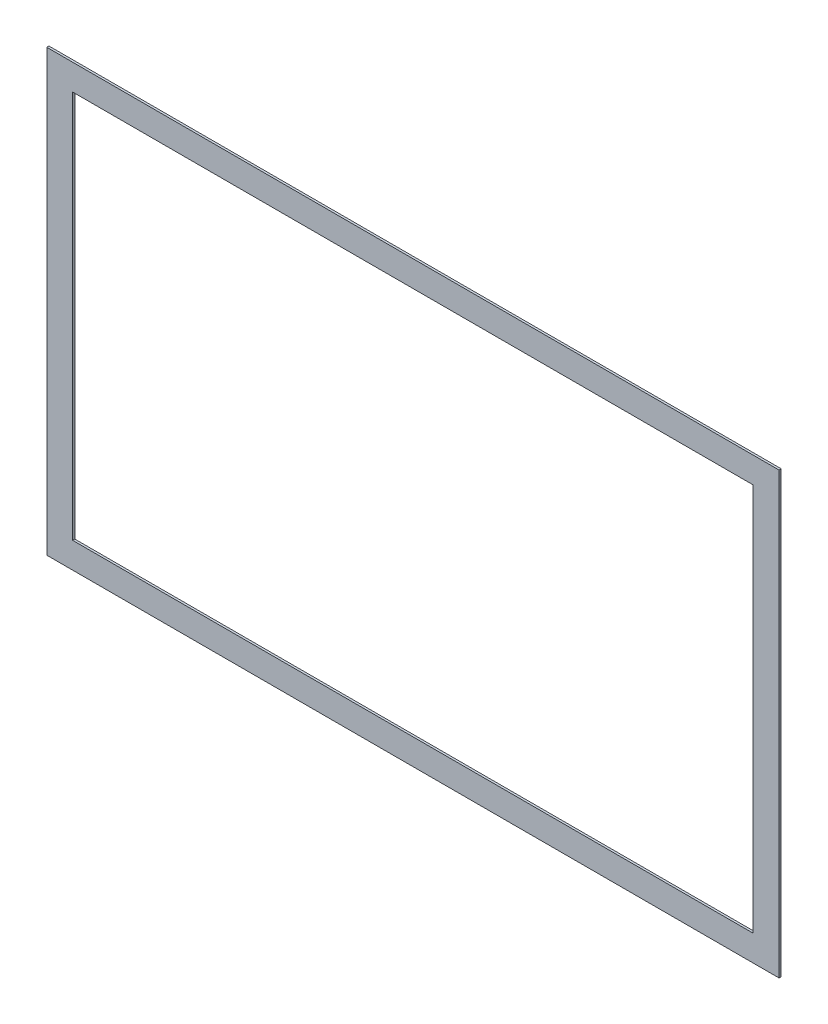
ISO-10303-21;
HEADER;
FILE_DESCRIPTION(('STEP AP214'),'2;1');
FILE_NAME('part.step','',(''),(''),'','','');
FILE_SCHEMA(('AUTOMOTIVE_DESIGN { 1 0 10303 214 1 1 1 1 }'));
ENDSEC;
DATA;
#1=APPLICATION_CONTEXT('core data for automotive mechanical design processes');
#2=APPLICATION_PROTOCOL_DEFINITION('international standard','automotive_design',2000,#1);
#3=PRODUCT_CONTEXT('',#1,'mechanical');
#4=PRODUCT('Part','Part','',(#3));
#5=PRODUCT_RELATED_PRODUCT_CATEGORY('part','',(#4));
#6=PRODUCT_DEFINITION_FORMATION('','',#4);
#7=PRODUCT_DEFINITION_CONTEXT('part definition',#1,'design');
#8=PRODUCT_DEFINITION('design','',#6,#7);
#9=PRODUCT_DEFINITION_SHAPE('','',#8);
#10=(LENGTH_UNIT() NAMED_UNIT(*) SI_UNIT(.MILLI.,.METRE.));
#11=(NAMED_UNIT(*) PLANE_ANGLE_UNIT() SI_UNIT($,.RADIAN.));
#12=(NAMED_UNIT(*) SI_UNIT($,.STERADIAN.) SOLID_ANGLE_UNIT());
#13=UNCERTAINTY_MEASURE_WITH_UNIT(LENGTH_MEASURE(1.E-05),#10,'distance_accuracy_value','');
#14=(GEOMETRIC_REPRESENTATION_CONTEXT(3) GLOBAL_UNCERTAINTY_ASSIGNED_CONTEXT((#13)) GLOBAL_UNIT_ASSIGNED_CONTEXT((#10,
#11,#12)) REPRESENTATION_CONTEXT('',''));
#15=CARTESIAN_POINT('',(0.,0.,0.));
#16=DIRECTION('',(0.,0.,1.));
#17=DIRECTION('',(1.,0.,0.));
#18=AXIS2_PLACEMENT_3D('',#15,#16,#17);
#19=CARTESIAN_POINT('',(0.,647.,3.2));
#20=DIRECTION('',(0.,0.,-1.));
#21=DIRECTION('',(-1.,0.,0.));
#22=AXIS2_PLACEMENT_3D('',#19,#20,#21);
#23=PLANE('',#22);
#24=DIRECTION('',(0.,-1.,0.));
#25=VECTOR('',#24,1.);
#26=CARTESIAN_POINT('',(0.,0.,3.2));
#27=LINE('',#26,#25);
#28=CARTESIAN_POINT('',(0.,647.,3.2));
#29=VERTEX_POINT('',#28);
#30=CARTESIAN_POINT('',(0.,0.,3.2));
#31=VERTEX_POINT('',#30);
#32=EDGE_CURVE('E132',#29,#31,#27,.T.);
#33=ORIENTED_EDGE('',*,*,#32,.T.);
#34=DIRECTION('',(1.,0.,0.));
#35=VECTOR('',#34,1.);
#36=CARTESIAN_POINT('',(0.,0.,3.2));
#37=LINE('',#36,#35);
#38=CARTESIAN_POINT('',(1077.,0.,3.2));
#39=VERTEX_POINT('',#38);
#40=EDGE_CURVE('E135',#31,#39,#37,.T.);
#41=ORIENTED_EDGE('',*,*,#40,.T.);
#42=DIRECTION('',(0.,1.,0.));
#43=VECTOR('',#42,1.);
#44=CARTESIAN_POINT('',(1077.,0.,3.2));
#45=LINE('',#44,#43);
#46=CARTESIAN_POINT('',(1077.,647.,3.2));
#47=VERTEX_POINT('',#46);
#48=EDGE_CURVE('E138',#39,#47,#45,.T.);
#49=ORIENTED_EDGE('',*,*,#48,.T.);
#50=DIRECTION('',(-1.,0.,0.));
#51=VECTOR('',#50,1.);
#52=CARTESIAN_POINT('',(0.,647.,3.2));
#53=LINE('',#52,#51);
#54=EDGE_CURVE('E140',#47,#29,#53,.T.);
#55=ORIENTED_EDGE('',*,*,#54,.T.);
#56=EDGE_LOOP('',(#33,#41,#49,#55));
#57=FACE_BOUND('',#56,.T.);
#58=DIRECTION('',(0.,-1.,0.));
#59=VECTOR('',#58,1.);
#60=CARTESIAN_POINT('',(38.,38.,3.2));
#61=LINE('',#60,#59);
#62=CARTESIAN_POINT('',(38.,609.,3.2));
#63=VERTEX_POINT('',#62);
#64=CARTESIAN_POINT('',(38.,38.,3.2));
#65=VERTEX_POINT('',#64);
#66=EDGE_CURVE('E96',#63,#65,#61,.T.);
#67=ORIENTED_EDGE('',*,*,#66,.F.);
#68=DIRECTION('',(-1.,0.,0.));
#69=VECTOR('',#68,1.);
#70=CARTESIAN_POINT('',(38.,609.,3.2));
#71=LINE('',#70,#69);
#72=CARTESIAN_POINT('',(1039.,609.,3.2));
#73=VERTEX_POINT('',#72);
#74=EDGE_CURVE('E118',#73,#63,#71,.T.);
#75=ORIENTED_EDGE('',*,*,#74,.F.);
#76=DIRECTION('',(0.,1.,0.));
#77=VECTOR('',#76,1.);
#78=CARTESIAN_POINT('',(1039.,38.,3.2));
#79=LINE('',#78,#77);
#80=CARTESIAN_POINT('',(1039.,38.,3.2));
#81=VERTEX_POINT('',#80);
#82=EDGE_CURVE('E116',#81,#73,#79,.T.);
#83=ORIENTED_EDGE('',*,*,#82,.F.);
#84=DIRECTION('',(1.,0.,0.));
#85=VECTOR('',#84,1.);
#86=CARTESIAN_POINT('',(38.,38.,3.2));
#87=LINE('',#86,#85);
#88=EDGE_CURVE('E104',#65,#81,#87,.T.);
#89=ORIENTED_EDGE('',*,*,#88,.F.);
#90=EDGE_LOOP('',(#67,#75,#83,#89));
#91=FACE_BOUND('',#90,.T.);
#92=ADVANCED_FACE('F31',(#57,#91),#23,.F.);
#93=CARTESIAN_POINT('',(0.,647.,0.));
#94=DIRECTION('',(0.,0.,-1.));
#95=DIRECTION('',(-1.,0.,0.));
#96=AXIS2_PLACEMENT_3D('',#93,#94,#95);
#97=PLANE('',#96);
#98=DIRECTION('',(0.,-1.,0.));
#99=VECTOR('',#98,1.);
#100=CARTESIAN_POINT('',(0.,0.,0.));
#101=LINE('',#100,#99);
#102=CARTESIAN_POINT('',(0.,647.,0.));
#103=VERTEX_POINT('',#102);
#104=CARTESIAN_POINT('',(0.,0.,0.));
#105=VERTEX_POINT('',#104);
#106=EDGE_CURVE('E112',#103,#105,#101,.T.);
#107=ORIENTED_EDGE('',*,*,#106,.F.);
#108=DIRECTION('',(-1.,0.,0.));
#109=VECTOR('',#108,1.);
#110=CARTESIAN_POINT('',(0.,647.,0.));
#111=LINE('',#110,#109);
#112=CARTESIAN_POINT('',(1077.,647.,0.));
#113=VERTEX_POINT('',#112);
#114=EDGE_CURVE('E136',#113,#103,#111,.T.);
#115=ORIENTED_EDGE('',*,*,#114,.F.);
#116=DIRECTION('',(0.,1.,0.));
#117=VECTOR('',#116,1.);
#118=CARTESIAN_POINT('',(1077.,0.,0.));
#119=LINE('',#118,#117);
#120=CARTESIAN_POINT('',(1077.,0.,0.));
#121=VERTEX_POINT('',#120);
#122=EDGE_CURVE('E147',#121,#113,#119,.T.);
#123=ORIENTED_EDGE('',*,*,#122,.F.);
#124=DIRECTION('',(1.,0.,0.));
#125=VECTOR('',#124,1.);
#126=CARTESIAN_POINT('',(0.,0.,0.));
#127=LINE('',#126,#125);
#128=EDGE_CURVE('E145',#105,#121,#127,.T.);
#129=ORIENTED_EDGE('',*,*,#128,.F.);
#130=EDGE_LOOP('',(#107,#115,#123,#129));
#131=FACE_BOUND('',#130,.T.);
#132=DIRECTION('',(-1.,0.,0.));
#133=VECTOR('',#132,1.);
#134=CARTESIAN_POINT('',(38.,609.,0.));
#135=LINE('',#134,#133);
#136=CARTESIAN_POINT('',(1039.,609.,0.));
#137=VERTEX_POINT('',#136);
#138=CARTESIAN_POINT('',(38.,609.,0.));
#139=VERTEX_POINT('',#138);
#140=EDGE_CURVE('E105',#137,#139,#135,.T.);
#141=ORIENTED_EDGE('',*,*,#140,.T.);
#142=DIRECTION('',(0.,-1.,0.));
#143=VECTOR('',#142,1.);
#144=CARTESIAN_POINT('',(38.,38.,0.));
#145=LINE('',#144,#143);
#146=CARTESIAN_POINT('',(38.,38.,0.));
#147=VERTEX_POINT('',#146);
#148=EDGE_CURVE('E54',#139,#147,#145,.T.);
#149=ORIENTED_EDGE('',*,*,#148,.T.);
#150=DIRECTION('',(1.,0.,0.));
#151=VECTOR('',#150,1.);
#152=CARTESIAN_POINT('',(38.,38.,0.));
#153=LINE('',#152,#151);
#154=CARTESIAN_POINT('',(1039.,38.,0.));
#155=VERTEX_POINT('',#154);
#156=EDGE_CURVE('E111',#147,#155,#153,.T.);
#157=ORIENTED_EDGE('',*,*,#156,.T.);
#158=DIRECTION('',(0.,1.,0.));
#159=VECTOR('',#158,1.);
#160=CARTESIAN_POINT('',(1039.,38.,0.));
#161=LINE('',#160,#159);
#162=EDGE_CURVE('E124',#155,#137,#161,.T.);
#163=ORIENTED_EDGE('',*,*,#162,.T.);
#164=EDGE_LOOP('',(#141,#149,#157,#163));
#165=FACE_BOUND('',#164,.T.);
#166=ADVANCED_FACE('F165',(#131,#165),#97,.T.);
#167=CARTESIAN_POINT('',(0.,0.,3.2));
#168=DIRECTION('',(1.,0.,0.));
#169=DIRECTION('',(0.,0.,-1.));
#170=AXIS2_PLACEMENT_3D('',#167,#168,#169);
#171=PLANE('',#170);
#172=ORIENTED_EDGE('',*,*,#106,.T.);
#173=DIRECTION('',(0.,0.,-1.));
#174=VECTOR('',#173,1.);
#175=CARTESIAN_POINT('',(0.,0.,3.2));
#176=LINE('',#175,#174);
#177=EDGE_CURVE('E11',#31,#105,#176,.T.);
#178=ORIENTED_EDGE('',*,*,#177,.F.);
#179=ORIENTED_EDGE('',*,*,#32,.F.);
#180=DIRECTION('',(0.,0.,-1.));
#181=VECTOR('',#180,1.);
#182=CARTESIAN_POINT('',(0.,647.,3.2));
#183=LINE('',#182,#181);
#184=EDGE_CURVE('E142',#29,#103,#183,.T.);
#185=ORIENTED_EDGE('',*,*,#184,.T.);
#186=EDGE_LOOP('',(#172,#178,#179,#185));
#187=FACE_BOUND('',#186,.T.);
#188=ADVANCED_FACE('F33',(#187),#171,.F.);
#189=CARTESIAN_POINT('',(0.,0.,3.2));
#190=DIRECTION('',(0.,1.,0.));
#191=DIRECTION('',(0.,0.,1.));
#192=AXIS2_PLACEMENT_3D('',#189,#190,#191);
#193=PLANE('',#192);
#194=ORIENTED_EDGE('',*,*,#128,.T.);
#195=DIRECTION('',(0.,0.,-1.));
#196=VECTOR('',#195,1.);
#197=CARTESIAN_POINT('',(1077.,0.,3.2));
#198=LINE('',#197,#196);
#199=EDGE_CURVE('E39',#39,#121,#198,.T.);
#200=ORIENTED_EDGE('',*,*,#199,.F.);
#201=ORIENTED_EDGE('',*,*,#40,.F.);
#202=ORIENTED_EDGE('',*,*,#177,.T.);
#203=EDGE_LOOP('',(#194,#200,#201,#202));
#204=FACE_BOUND('',#203,.T.);
#205=ADVANCED_FACE('F175',(#204),#193,.F.);
#206=CARTESIAN_POINT('',(1077.,0.,3.2));
#207=DIRECTION('',(-1.,0.,0.));
#208=DIRECTION('',(0.,0.,1.));
#209=AXIS2_PLACEMENT_3D('',#206,#207,#208);
#210=PLANE('',#209);
#211=ORIENTED_EDGE('',*,*,#122,.T.);
#212=DIRECTION('',(0.,0.,-1.));
#213=VECTOR('',#212,1.);
#214=CARTESIAN_POINT('',(1077.,647.,3.2));
#215=LINE('',#214,#213);
#216=EDGE_CURVE('E152',#47,#113,#215,.T.);
#217=ORIENTED_EDGE('',*,*,#216,.F.);
#218=ORIENTED_EDGE('',*,*,#48,.F.);
#219=ORIENTED_EDGE('',*,*,#199,.T.);
#220=EDGE_LOOP('',(#211,#217,#218,#219));
#221=FACE_BOUND('',#220,.T.);
#222=ADVANCED_FACE('F159',(#221),#210,.F.);
#223=CARTESIAN_POINT('',(0.,647.,3.2));
#224=DIRECTION('',(0.,-1.,0.));
#225=DIRECTION('',(0.,0.,-1.));
#226=AXIS2_PLACEMENT_3D('',#223,#224,#225);
#227=PLANE('',#226);
#228=ORIENTED_EDGE('',*,*,#114,.T.);
#229=ORIENTED_EDGE('',*,*,#184,.F.);
#230=ORIENTED_EDGE('',*,*,#54,.F.);
#231=ORIENTED_EDGE('',*,*,#216,.T.);
#232=EDGE_LOOP('',(#228,#229,#230,#231));
#233=FACE_BOUND('',#232,.T.);
#234=ADVANCED_FACE('F169',(#233),#227,.F.);
#235=CARTESIAN_POINT('',(38.,38.,3.2));
#236=DIRECTION('',(1.,0.,0.));
#237=DIRECTION('',(0.,1.,0.));
#238=AXIS2_PLACEMENT_3D('',#235,#236,#237);
#239=PLANE('',#238);
#240=ORIENTED_EDGE('',*,*,#148,.F.);
#241=DIRECTION('',(0.,0.,-1.));
#242=VECTOR('',#241,1.);
#243=CARTESIAN_POINT('',(38.,609.,3.2));
#244=LINE('',#243,#242);
#245=EDGE_CURVE('E100',#63,#139,#244,.T.);
#246=ORIENTED_EDGE('',*,*,#245,.F.);
#247=ORIENTED_EDGE('',*,*,#66,.T.);
#248=DIRECTION('',(0.,0.,-1.));
#249=VECTOR('',#248,1.);
#250=CARTESIAN_POINT('',(38.,38.,3.2));
#251=LINE('',#250,#249);
#252=EDGE_CURVE('E99',#65,#147,#251,.T.);
#253=ORIENTED_EDGE('',*,*,#252,.T.);
#254=EDGE_LOOP('',(#240,#246,#247,#253));
#255=FACE_BOUND('',#254,.T.);
#256=ADVANCED_FACE('F98',(#255),#239,.T.);
#257=CARTESIAN_POINT('',(38.,38.,3.2));
#258=DIRECTION('',(0.,1.,0.));
#259=DIRECTION('',(0.,0.,1.));
#260=AXIS2_PLACEMENT_3D('',#257,#258,#259);
#261=PLANE('',#260);
#262=ORIENTED_EDGE('',*,*,#156,.F.);
#263=ORIENTED_EDGE('',*,*,#252,.F.);
#264=ORIENTED_EDGE('',*,*,#88,.T.);
#265=DIRECTION('',(0.,0.,-1.));
#266=VECTOR('',#265,1.);
#267=CARTESIAN_POINT('',(1039.,38.,3.2));
#268=LINE('',#267,#266);
#269=EDGE_CURVE('E113',#81,#155,#268,.T.);
#270=ORIENTED_EDGE('',*,*,#269,.T.);
#271=EDGE_LOOP('',(#262,#263,#264,#270));
#272=FACE_BOUND('',#271,.T.);
#273=ADVANCED_FACE('F108',(#272),#261,.T.);
#274=CARTESIAN_POINT('',(1039.,38.,3.2));
#275=DIRECTION('',(-1.,0.,0.));
#276=DIRECTION('',(0.,-1.,0.));
#277=AXIS2_PLACEMENT_3D('',#274,#275,#276);
#278=PLANE('',#277);
#279=ORIENTED_EDGE('',*,*,#162,.F.);
#280=ORIENTED_EDGE('',*,*,#269,.F.);
#281=ORIENTED_EDGE('',*,*,#82,.T.);
#282=DIRECTION('',(0.,0.,-1.));
#283=VECTOR('',#282,1.);
#284=CARTESIAN_POINT('',(1039.,609.,3.2));
#285=LINE('',#284,#283);
#286=EDGE_CURVE('E46',#73,#137,#285,.T.);
#287=ORIENTED_EDGE('',*,*,#286,.T.);
#288=EDGE_LOOP('',(#279,#280,#281,#287));
#289=FACE_BOUND('',#288,.T.);
#290=ADVANCED_FACE('F198',(#289),#278,.T.);
#291=CARTESIAN_POINT('',(38.,609.,3.2));
#292=DIRECTION('',(0.,-1.,0.));
#293=DIRECTION('',(0.,0.,-1.));
#294=AXIS2_PLACEMENT_3D('',#291,#292,#293);
#295=PLANE('',#294);
#296=ORIENTED_EDGE('',*,*,#140,.F.);
#297=ORIENTED_EDGE('',*,*,#286,.F.);
#298=ORIENTED_EDGE('',*,*,#74,.T.);
#299=ORIENTED_EDGE('',*,*,#245,.T.);
#300=EDGE_LOOP('',(#296,#297,#298,#299));
#301=FACE_BOUND('',#300,.T.);
#302=ADVANCED_FACE('F202',(#301),#295,.T.);
#303=CLOSED_SHELL('',(#92,#166,#188,#205,#222,#234,#256,#273,#290,#302));
#304=MANIFOLD_SOLID_BREP('B2',#303);
#305=ADVANCED_BREP_SHAPE_REPRESENTATION('',(#18,#304),#14);
#306=SHAPE_DEFINITION_REPRESENTATION(#9,#305);
ENDSEC;
END-ISO-10303-21;
